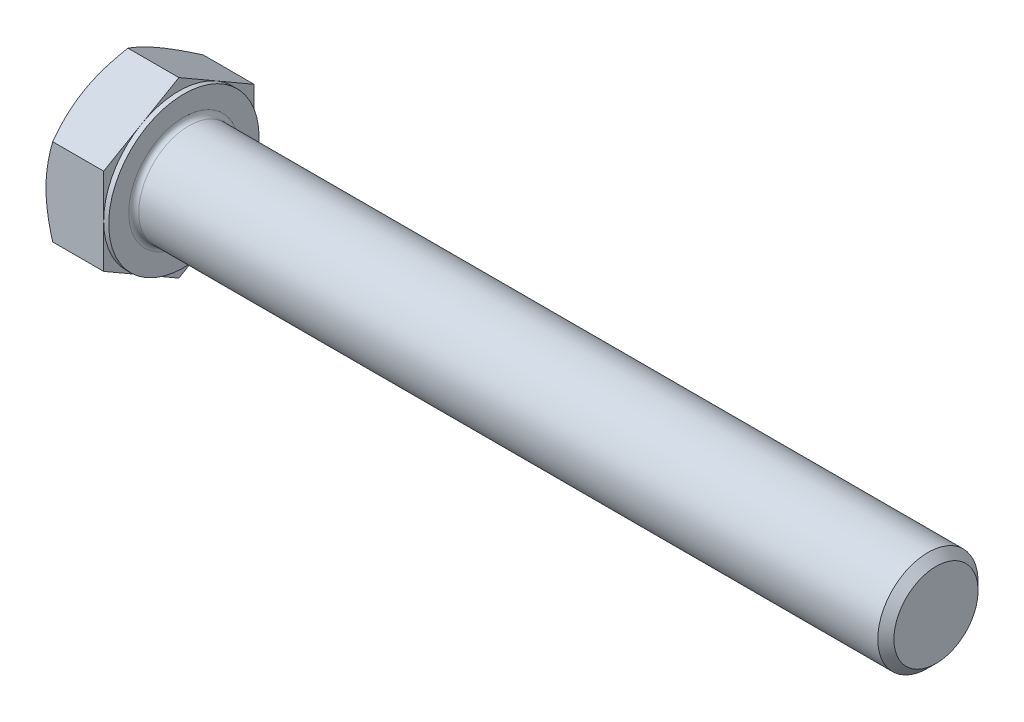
ISO-10303-21;
HEADER;
FILE_DESCRIPTION(('STEP AP214'),'2;1');
FILE_NAME('part.step','',(''),(''),'','','');
FILE_SCHEMA(('AUTOMOTIVE_DESIGN { 1 0 10303 214 1 1 1 1 }'));
ENDSEC;
DATA;
#1=APPLICATION_CONTEXT('core data for automotive mechanical design processes');
#2=APPLICATION_PROTOCOL_DEFINITION('international standard','automotive_design',2000,#1);
#3=PRODUCT_CONTEXT('',#1,'mechanical');
#4=PRODUCT('Part','Part','',(#3));
#5=PRODUCT_RELATED_PRODUCT_CATEGORY('part','',(#4));
#6=PRODUCT_DEFINITION_FORMATION('','',#4);
#7=PRODUCT_DEFINITION_CONTEXT('part definition',#1,'design');
#8=PRODUCT_DEFINITION('design','',#6,#7);
#9=PRODUCT_DEFINITION_SHAPE('','',#8);
#10=(LENGTH_UNIT() NAMED_UNIT(*) SI_UNIT(.MILLI.,.METRE.));
#11=(NAMED_UNIT(*) PLANE_ANGLE_UNIT() SI_UNIT($,.RADIAN.));
#12=(NAMED_UNIT(*) SI_UNIT($,.STERADIAN.) SOLID_ANGLE_UNIT());
#13=UNCERTAINTY_MEASURE_WITH_UNIT(LENGTH_MEASURE(1.E-05),#10,'distance_accuracy_value','');
#14=(GEOMETRIC_REPRESENTATION_CONTEXT(3) GLOBAL_UNCERTAINTY_ASSIGNED_CONTEXT((#13)) GLOBAL_UNIT_ASSIGNED_CONTEXT((#10,
#11,#12)) REPRESENTATION_CONTEXT('',''));
#15=CARTESIAN_POINT('',(0.,0.,0.));
#16=DIRECTION('',(0.,0.,1.));
#17=DIRECTION('',(1.,0.,0.));
#18=AXIS2_PLACEMENT_3D('',#15,#16,#17);
#19=CARTESIAN_POINT('',(7.5,10.3923048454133,0.));
#20=DIRECTION('',(1.,0.,0.));
#21=DIRECTION('',(0.,0.,-1.));
#22=AXIS2_PLACEMENT_3D('',#19,#20,#21);
#23=PLANE('',#22);
#24=CARTESIAN_POINT('',(7.5,0.,0.));
#25=DIRECTION('',(1.,0.,0.));
#26=DIRECTION('',(0.,0.,-1.));
#27=AXIS2_PLACEMENT_3D('',#24,#25,#26);
#28=CIRCLE('',#27,6.6);
#29=CARTESIAN_POINT('',(7.5,0.,-6.6));
#30=VERTEX_POINT('',#29);
#31=EDGE_CURVE('E41',#30,#30,#28,.F.);
#32=ORIENTED_EDGE('',*,*,#31,.T.);
#33=EDGE_LOOP('',(#32));
#34=FACE_BOUND('',#33,.T.);
#35=CARTESIAN_POINT('',(7.5,0.,0.));
#36=DIRECTION('',(1.,0.,0.));
#37=DIRECTION('',(0.,0.,-1.));
#38=AXIS2_PLACEMENT_3D('',#35,#36,#37);
#39=CIRCLE('',#38,9.);
#40=CARTESIAN_POINT('',(7.5,0.,-9.));
#41=VERTEX_POINT('',#40);
#42=EDGE_CURVE('E292',#41,#41,#39,.T.);
#43=ORIENTED_EDGE('',*,*,#42,.T.);
#44=EDGE_LOOP('',(#43));
#45=FACE_BOUND('',#44,.T.);
#46=ADVANCED_FACE('F33',(#34,#45),#23,.T.);
#47=CARTESIAN_POINT('',(0.,0.,0.));
#48=DIRECTION('',(-1.,0.,0.));
#49=DIRECTION('',(0.,0.,1.));
#50=AXIS2_PLACEMENT_3D('',#47,#48,#49);
#51=CYLINDRICAL_SURFACE('',#50,6.);
#52=CARTESIAN_POINT('',(8.1,0.,0.));
#53=DIRECTION('',(1.,0.,0.));
#54=DIRECTION('',(0.,0.,-1.));
#55=AXIS2_PLACEMENT_3D('',#52,#53,#54);
#56=CIRCLE('',#55,6.);
#57=CARTESIAN_POINT('',(8.1,0.,-6.));
#58=VERTEX_POINT('',#57);
#59=EDGE_CURVE('E11',#58,#58,#56,.T.);
#60=ORIENTED_EDGE('',*,*,#59,.T.);
#61=EDGE_LOOP('',(#60));
#62=FACE_BOUND('',#61,.T.);
#63=CARTESIAN_POINT('',(96.536,0.,0.));
#64=DIRECTION('',(-1.,0.,0.));
#65=DIRECTION('',(0.,0.,1.));
#66=AXIS2_PLACEMENT_3D('',#63,#64,#65);
#67=CIRCLE('',#66,6.);
#68=CARTESIAN_POINT('',(96.536,0.,6.));
#69=VERTEX_POINT('',#68);
#70=EDGE_CURVE('E271',#69,#69,#67,.T.);
#71=ORIENTED_EDGE('',*,*,#70,.T.);
#72=EDGE_LOOP('',(#71));
#73=FACE_BOUND('',#72,.T.);
#74=ADVANCED_FACE('F245',(#62,#73),#51,.T.);
#75=CARTESIAN_POINT('',(97.5,0.,0.));
#76=DIRECTION('',(-1.,0.,0.));
#77=DIRECTION('',(0.,0.,1.));
#78=AXIS2_PLACEMENT_3D('',#75,#76,#77);
#79=CONICAL_SURFACE('',#78,5.036,0.785398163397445);
#80=ORIENTED_EDGE('',*,*,#70,.F.);
#81=EDGE_LOOP('',(#80));
#82=FACE_BOUND('',#81,.T.);
#83=CARTESIAN_POINT('',(97.5,0.,0.));
#84=DIRECTION('',(-1.,0.,0.));
#85=DIRECTION('',(0.,0.,1.));
#86=AXIS2_PLACEMENT_3D('',#83,#84,#85);
#87=CIRCLE('',#86,5.036);
#88=CARTESIAN_POINT('',(97.5,0.,5.036));
#89=VERTEX_POINT('',#88);
#90=EDGE_CURVE('E269',#89,#89,#87,.T.);
#91=ORIENTED_EDGE('',*,*,#90,.T.);
#92=EDGE_LOOP('',(#91));
#93=FACE_BOUND('',#92,.T.);
#94=ADVANCED_FACE('F250',(#82,#93),#79,.T.);
#95=CARTESIAN_POINT('',(97.5,0.,0.));
#96=DIRECTION('',(-1.,0.,0.));
#97=DIRECTION('',(0.,0.,1.));
#98=AXIS2_PLACEMENT_3D('',#95,#96,#97);
#99=PLANE('',#98);
#100=ORIENTED_EDGE('',*,*,#90,.F.);
#101=EDGE_LOOP('',(#100));
#102=FACE_BOUND('',#101,.T.);
#103=ADVANCED_FACE('F257',(#102),#99,.F.);
#104=CARTESIAN_POINT('',(6.9,9.,0.));
#105=DIRECTION('',(1.,0.,0.));
#106=DIRECTION('',(0.,0.,-1.));
#107=AXIS2_PLACEMENT_3D('',#104,#105,#106);
#108=PLANE('',#107);
#109=DIRECTION('',(0.,0.500000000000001,0.866025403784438));
#110=VECTOR('',#109,1.);
#111=CARTESIAN_POINT('',(6.9,5.19615242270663,-9.));
#112=LINE('',#111,#110);
#113=CARTESIAN_POINT('',(6.9,5.19615242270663,-9.));
#114=VERTEX_POINT('',#113);
#115=CARTESIAN_POINT('',(6.9,7.79422863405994,-4.50000000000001));
#116=VERTEX_POINT('',#115);
#117=EDGE_CURVE('E165',#114,#116,#112,.T.);
#118=ORIENTED_EDGE('',*,*,#117,.T.);
#119=CARTESIAN_POINT('',(6.9,0.,0.));
#120=DIRECTION('',(-1.,0.,0.));
#121=DIRECTION('',(0.,0.,1.));
#122=AXIS2_PLACEMENT_3D('',#119,#120,#121);
#123=CIRCLE('',#122,9.);
#124=CARTESIAN_POINT('',(6.9,0.,-9.));
#125=VERTEX_POINT('',#124);
#126=EDGE_CURVE('E48',#116,#125,#123,.T.);
#127=ORIENTED_EDGE('',*,*,#126,.T.);
#128=DIRECTION('',(0.,1.,0.));
#129=VECTOR('',#128,1.);
#130=CARTESIAN_POINT('',(6.9,5.19615242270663,-9.));
#131=LINE('',#130,#129);
#132=EDGE_CURVE('E295',#125,#114,#131,.T.);
#133=ORIENTED_EDGE('',*,*,#132,.T.);
#134=EDGE_LOOP('',(#118,#127,#133));
#135=FACE_BOUND('',#134,.T.);
#136=ADVANCED_FACE('F260',(#135),#108,.T.);
#137=CARTESIAN_POINT('',(6.9,10.3923048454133,0.));
#138=VERTEX_POINT('',#137);
#139=EDGE_CURVE('E163',#116,#138,#112,.T.);
#140=ORIENTED_EDGE('',*,*,#139,.T.);
#141=DIRECTION('',(0.,-0.500000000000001,0.866025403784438));
#142=VECTOR('',#141,1.);
#143=CARTESIAN_POINT('',(6.9,10.3923048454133,0.));
#144=LINE('',#143,#142);
#145=CARTESIAN_POINT('',(6.9,7.79422863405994,4.50000000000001));
#146=VERTEX_POINT('',#145);
#147=EDGE_CURVE('E162',#138,#146,#144,.T.);
#148=ORIENTED_EDGE('',*,*,#147,.T.);
#149=EDGE_CURVE('E151',#146,#116,#123,.T.);
#150=ORIENTED_EDGE('',*,*,#149,.T.);
#151=EDGE_LOOP('',(#140,#148,#150));
#152=FACE_BOUND('',#151,.T.);
#153=ADVANCED_FACE('F265',(#152),#108,.T.);
#154=CARTESIAN_POINT('',(6.9,5.19615242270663,9.));
#155=VERTEX_POINT('',#154);
#156=EDGE_CURVE('E130',#146,#155,#144,.T.);
#157=ORIENTED_EDGE('',*,*,#156,.T.);
#158=DIRECTION('',(0.,-1.,0.));
#159=VECTOR('',#158,1.);
#160=CARTESIAN_POINT('',(6.9,5.19615242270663,9.));
#161=LINE('',#160,#159);
#162=CARTESIAN_POINT('',(6.9,0.,9.));
#163=VERTEX_POINT('',#162);
#164=EDGE_CURVE('E124',#155,#163,#161,.T.);
#165=ORIENTED_EDGE('',*,*,#164,.T.);
#166=EDGE_CURVE('E128',#163,#146,#123,.T.);
#167=ORIENTED_EDGE('',*,*,#166,.T.);
#168=EDGE_LOOP('',(#157,#165,#167));
#169=FACE_BOUND('',#168,.T.);
#170=ADVANCED_FACE('F126',(#169),#108,.T.);
#171=CARTESIAN_POINT('',(6.9,-5.1961524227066,9.));
#172=VERTEX_POINT('',#171);
#173=EDGE_CURVE('E134',#163,#172,#161,.T.);
#174=ORIENTED_EDGE('',*,*,#173,.T.);
#175=DIRECTION('',(0.,-0.500000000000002,-0.866025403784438));
#176=VECTOR('',#175,1.);
#177=CARTESIAN_POINT('',(6.9,-10.3923048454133,0.));
#178=LINE('',#177,#176);
#179=CARTESIAN_POINT('',(6.9,-7.79422863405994,4.50000000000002));
#180=VERTEX_POINT('',#179);
#181=EDGE_CURVE('E141',#172,#180,#178,.T.);
#182=ORIENTED_EDGE('',*,*,#181,.T.);
#183=EDGE_CURVE('E138',#180,#163,#123,.T.);
#184=ORIENTED_EDGE('',*,*,#183,.T.);
#185=EDGE_LOOP('',(#174,#182,#184));
#186=FACE_BOUND('',#185,.T.);
#187=ADVANCED_FACE('F139',(#186),#108,.T.);
#188=CARTESIAN_POINT('',(6.9,-10.3923048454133,0.));
#189=VERTEX_POINT('',#188);
#190=EDGE_CURVE('E157',#180,#189,#178,.T.);
#191=ORIENTED_EDGE('',*,*,#190,.T.);
#192=DIRECTION('',(0.,0.499999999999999,-0.866025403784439));
#193=VECTOR('',#192,1.);
#194=CARTESIAN_POINT('',(6.9,-5.19615242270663,-9.));
#195=LINE('',#194,#193);
#196=CARTESIAN_POINT('',(6.9,-7.79422863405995,-4.49999999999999));
#197=VERTEX_POINT('',#196);
#198=EDGE_CURVE('E333',#189,#197,#195,.T.);
#199=ORIENTED_EDGE('',*,*,#198,.T.);
#200=EDGE_CURVE('E145',#197,#180,#123,.T.);
#201=ORIENTED_EDGE('',*,*,#200,.T.);
#202=EDGE_LOOP('',(#191,#199,#201));
#203=FACE_BOUND('',#202,.T.);
#204=ADVANCED_FACE('F334',(#203),#108,.T.);
#205=CARTESIAN_POINT('',(6.9,-5.19615242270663,-9.));
#206=VERTEX_POINT('',#205);
#207=EDGE_CURVE('E152',#197,#206,#195,.T.);
#208=ORIENTED_EDGE('',*,*,#207,.T.);
#209=EDGE_CURVE('E296',#206,#125,#131,.T.);
#210=ORIENTED_EDGE('',*,*,#209,.T.);
#211=EDGE_CURVE('E303',#125,#197,#123,.T.);
#212=ORIENTED_EDGE('',*,*,#211,.T.);
#213=EDGE_LOOP('',(#208,#210,#212));
#214=FACE_BOUND('',#213,.T.);
#215=ADVANCED_FACE('F266',(#214),#108,.T.);
#216=CARTESIAN_POINT('',(0.,0.,0.));
#217=DIRECTION('',(-1.,0.,0.));
#218=DIRECTION('',(0.,0.,1.));
#219=AXIS2_PLACEMENT_3D('',#216,#217,#218);
#220=CYLINDRICAL_SURFACE('',#219,9.);
#221=ORIENTED_EDGE('',*,*,#126,.F.);
#222=ORIENTED_EDGE('',*,*,#149,.F.);
#223=ORIENTED_EDGE('',*,*,#166,.F.);
#224=ORIENTED_EDGE('',*,*,#183,.F.);
#225=ORIENTED_EDGE('',*,*,#200,.F.);
#226=ORIENTED_EDGE('',*,*,#211,.F.);
#227=EDGE_LOOP('',(#221,#222,#223,#224,#225,#226));
#228=FACE_BOUND('',#227,.T.);
#229=ORIENTED_EDGE('',*,*,#42,.F.);
#230=EDGE_LOOP('',(#229));
#231=FACE_BOUND('',#230,.T.);
#232=ADVANCED_FACE('F148',(#228,#231),#220,.T.);
#233=CARTESIAN_POINT('',(0.,10.3923048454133,0.));
#234=DIRECTION('',(1.,0.,0.));
#235=DIRECTION('',(0.,0.,-1.));
#236=AXIS2_PLACEMENT_3D('',#233,#234,#235);
#237=PLANE('',#236);
#238=CARTESIAN_POINT('',(0.,0.,0.));
#239=DIRECTION('',(1.,0.,0.));
#240=DIRECTION('',(0.,0.,-1.));
#241=AXIS2_PLACEMENT_3D('',#238,#239,#240);
#242=CIRCLE('',#241,9.);
#243=CARTESIAN_POINT('',(0.,0.,-9.));
#244=VERTEX_POINT('',#243);
#245=CARTESIAN_POINT('',(0.,7.79422863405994,-4.50000000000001));
#246=VERTEX_POINT('',#245);
#247=EDGE_CURVE('E291',#244,#246,#242,.T.);
#248=ORIENTED_EDGE('',*,*,#247,.F.);
#249=CARTESIAN_POINT('',(0.,-7.79422863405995,-4.49999999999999));
#250=VERTEX_POINT('',#249);
#251=EDGE_CURVE('E287',#250,#244,#242,.T.);
#252=ORIENTED_EDGE('',*,*,#251,.F.);
#253=CARTESIAN_POINT('',(0.,-7.79422863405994,4.50000000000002));
#254=VERTEX_POINT('',#253);
#255=EDGE_CURVE('E290',#254,#250,#242,.T.);
#256=ORIENTED_EDGE('',*,*,#255,.F.);
#257=CARTESIAN_POINT('',(0.,0.,9.));
#258=VERTEX_POINT('',#257);
#259=EDGE_CURVE('E326',#258,#254,#242,.T.);
#260=ORIENTED_EDGE('',*,*,#259,.F.);
#261=CARTESIAN_POINT('',(0.,0.,0.));
#262=DIRECTION('',(-1.,0.,0.));
#263=DIRECTION('',(0.,0.,1.));
#264=AXIS2_PLACEMENT_3D('',#261,#262,#263);
#265=CIRCLE('',#264,9.);
#266=CARTESIAN_POINT('',(0.,7.79422863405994,4.50000000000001));
#267=VERTEX_POINT('',#266);
#268=EDGE_CURVE('E166',#258,#267,#265,.T.);
#269=ORIENTED_EDGE('',*,*,#268,.T.);
#270=EDGE_CURVE('E349',#246,#267,#242,.T.);
#271=ORIENTED_EDGE('',*,*,#270,.F.);
#272=EDGE_LOOP('',(#248,#252,#256,#260,#269,#271));
#273=FACE_BOUND('',#272,.T.);
#274=ADVANCED_FACE('F195',(#273),#237,.F.);
#275=CARTESIAN_POINT('',(0.,0.,0.));
#276=DIRECTION('',(1.,0.,0.));
#277=DIRECTION('',(0.,0.,-1.));
#278=AXIS2_PLACEMENT_3D('',#275,#276,#277);
#279=CONICAL_SURFACE('',#278,9.,1.0471975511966);
#280=CARTESIAN_POINT('',(0.803914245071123,5.19603695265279,9.0002));
#281=CARTESIAN_POINT('',(0.737982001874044,5.31024090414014,8.80239295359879));
#282=CARTESIAN_POINT('',(0.675041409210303,5.42489028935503,8.60381439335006));
#283=CARTESIAN_POINT('',(0.555968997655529,5.65512011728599,8.20504463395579));
#284=CARTESIAN_POINT('',(0.499840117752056,5.77070093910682,8.00485277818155));
#285=CARTESIAN_POINT('',(0.395151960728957,6.00300811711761,7.60248494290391));
#286=CARTESIAN_POINT('',(0.346610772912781,6.11973652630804,7.40030540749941));
#287=CARTESIAN_POINT('',(0.258148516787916,6.35398725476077,6.99457124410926));
#288=CARTESIAN_POINT('',(0.218225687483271,6.47150940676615,6.7910169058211));
#289=CARTESIAN_POINT('',(0.148684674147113,6.70436794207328,6.38769409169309));
#290=CARTESIAN_POINT('',(0.118837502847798,6.81968712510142,6.187955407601));
#291=CARTESIAN_POINT('',(0.0687933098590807,7.05084147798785,5.78758432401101));
#292=CARTESIAN_POINT('',(0.04859543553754,7.16667660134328,5.5869520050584));
#293=CARTESIAN_POINT('',(0.0183543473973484,7.39854776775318,5.18533936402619));
#294=CARTESIAN_POINT('',(0.00829960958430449,7.51458343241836,4.98435969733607));
#295=CARTESIAN_POINT('',(-0.00143766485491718,7.74676155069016,4.58221540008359));
#296=CARTESIAN_POINT('',(-0.00112052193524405,7.86290400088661,4.38105077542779));
#297=CARTESIAN_POINT('',(0.00916395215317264,8.08003584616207,4.00496738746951));
#298=CARTESIAN_POINT('',(0.0178767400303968,8.18104055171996,3.83002210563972));
#299=CARTESIAN_POINT('',(0.0429773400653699,8.38281337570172,3.48054132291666));
#300=CARTESIAN_POINT('',(0.0593656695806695,8.4835814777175,3.30600585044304));
#301=CARTESIAN_POINT('',(0.11965655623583,8.7854956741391,2.7830751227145));
#302=CARTESIAN_POINT('',(0.174677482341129,8.98610736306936,2.43560548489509));
#303=CARTESIAN_POINT('',(0.312230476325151,9.38945876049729,1.73698037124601));
#304=CARTESIAN_POINT('',(0.395345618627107,9.59214699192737,1.38591405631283));
#305=CARTESIAN_POINT('',(0.583982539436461,9.99450087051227,0.689016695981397));
#306=CARTESIAN_POINT('',(0.689460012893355,10.1941716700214,0.343176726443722));
#307=CARTESIAN_POINT('',(0.803914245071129,10.3924203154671,-0.000200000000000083));
#308=B_SPLINE_CURVE_WITH_KNOTS('',3,(#280,#281,#282,#283,#284,#285,#286,#287,#288,#289,#290,
#291,#292,#293,#294,#295,#296,#297,#298,#299,#300,#301,#302,#303,#304,#305,#306,#307),
.UNSPECIFIED.,.F.,.F.,(4,2,2,2,2,2,2,2,2,2,2,2,2,4),(0.,0.713219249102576,1.42674513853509,
2.14194697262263,2.8570025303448,3.55449749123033,4.25193080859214,4.94857085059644,
5.64518936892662,6.25162976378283,6.8581110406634,8.07193747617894,9.31268391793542,
10.5509947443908),.UNSPECIFIED.);
#309=CARTESIAN_POINT('',(0.803847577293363,10.3923048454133,0.));
#310=VERTEX_POINT('',#309);
#311=EDGE_CURVE('E214',#267,#310,#308,.T.);
#312=ORIENTED_EDGE('',*,*,#311,.T.);
#313=CARTESIAN_POINT('',(0.803914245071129,10.3924203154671,0.000200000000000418));
#314=CARTESIAN_POINT('',(0.73798200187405,10.2782163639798,-0.197607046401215));
#315=CARTESIAN_POINT('',(0.675041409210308,10.1635669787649,-0.396185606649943));
#316=CARTESIAN_POINT('',(0.555968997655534,9.93333715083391,-0.794955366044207));
#317=CARTESIAN_POINT('',(0.499840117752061,9.81775632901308,-0.995147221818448));
#318=CARTESIAN_POINT('',(0.395151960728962,9.58544915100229,-1.39751505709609));
#319=CARTESIAN_POINT('',(0.346610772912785,9.46872074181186,-1.59969459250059));
#320=CARTESIAN_POINT('',(0.25814851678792,9.23447001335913,-2.00542875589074));
#321=CARTESIAN_POINT('',(0.218225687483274,9.11694786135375,-2.20898309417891));
#322=CARTESIAN_POINT('',(0.148684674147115,8.88408932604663,-2.61230590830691));
#323=CARTESIAN_POINT('',(0.1188375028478,8.76877014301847,-2.812044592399));
#324=CARTESIAN_POINT('',(0.0687933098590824,8.53761579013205,-3.21241567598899));
#325=CARTESIAN_POINT('',(0.048595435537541,8.42178066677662,-3.4130479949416));
#326=CARTESIAN_POINT('',(0.0183543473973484,8.18990950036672,-3.81466063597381));
#327=CARTESIAN_POINT('',(0.00829960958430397,8.07387383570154,-4.01564030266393));
#328=CARTESIAN_POINT('',(-0.00143766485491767,7.84169571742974,-4.41778459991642));
#329=CARTESIAN_POINT('',(-0.00112052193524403,7.72555326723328,-4.61894922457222));
#330=CARTESIAN_POINT('',(0.00916395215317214,7.50842142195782,-4.9950326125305));
#331=CARTESIAN_POINT('',(0.0178767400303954,7.40741671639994,-5.16997789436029));
#332=CARTESIAN_POINT('',(0.042977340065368,7.20564389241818,-5.51945867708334));
#333=CARTESIAN_POINT('',(0.0593656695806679,7.1048757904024,-5.69399414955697));
#334=CARTESIAN_POINT('',(0.119656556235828,6.8029615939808,-6.2169248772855));
#335=CARTESIAN_POINT('',(0.174677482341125,6.60234990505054,-6.56439451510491));
#336=CARTESIAN_POINT('',(0.312230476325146,6.1989985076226,-7.263019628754));
#337=CARTESIAN_POINT('',(0.395345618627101,5.99631027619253,-7.61408594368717));
#338=CARTESIAN_POINT('',(0.583982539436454,5.59395639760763,-8.3109833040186));
#339=CARTESIAN_POINT('',(0.689460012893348,5.39428559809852,-8.65682327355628));
#340=CARTESIAN_POINT('',(0.803914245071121,5.19603695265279,-9.0002));
#341=B_SPLINE_CURVE_WITH_KNOTS('',3,(#313,#314,#315,#316,#317,#318,#319,#320,#321,#322,#323,
#324,#325,#326,#327,#328,#329,#330,#331,#332,#333,#334,#335,#336,#337,#338,#339,#340),
.UNSPECIFIED.,.F.,.F.,(4,2,2,2,2,2,2,2,2,2,2,2,2,4),(0.,0.713219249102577,1.42674513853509,
2.14194697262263,2.8570025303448,3.55449749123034,4.25193080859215,4.94857085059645,
5.64518936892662,6.25162976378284,6.85811104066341,8.07193747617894,9.31268391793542,
10.5509947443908),.UNSPECIFIED.);
#342=EDGE_CURVE('E56',#310,#246,#341,.T.);
#343=ORIENTED_EDGE('',*,*,#342,.T.);
#344=ORIENTED_EDGE('',*,*,#270,.T.);
#345=EDGE_LOOP('',(#312,#343,#344));
#346=FACE_BOUND('',#345,.T.);
#347=ADVANCED_FACE('F350',(#346),#279,.T.);
#348=CARTESIAN_POINT('',(4.5030834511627,-14.1853984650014,8.99999999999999));
#349=CARTESIAN_POINT('',(4.31054430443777,-13.7903499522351,8.99999999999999));
#350=CARTESIAN_POINT('',(4.11978647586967,-13.3944187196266,8.99999999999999));
#351=CARTESIAN_POINT('',(3.74283090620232,-12.6003222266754,8.99999999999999));
#352=CARTESIAN_POINT('',(3.55663384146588,-12.2021566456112,9.));
#353=CARTESIAN_POINT('',(3.18890856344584,-11.4011783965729,9.));
#354=CARTESIAN_POINT('',(3.00740939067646,-10.9983523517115,9.));
#355=CARTESIAN_POINT('',(2.65153988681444,-10.1895752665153,9.));
#356=CARTESIAN_POINT('',(2.47716923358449,-9.7836243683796,9.));
#357=CARTESIAN_POINT('',(2.13161244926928,-8.95398189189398,9.));
#358=CARTESIAN_POINT('',(1.96074001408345,-8.53015895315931,9.));
#359=CARTESIAN_POINT('',(1.63138410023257,-7.67764040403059,9.));
#360=CARTESIAN_POINT('',(1.47290197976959,-7.24894426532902,9.));
#361=CARTESIAN_POINT('',(1.17232155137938,-6.38672363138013,9.));
#362=CARTESIAN_POINT('',(1.03019194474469,-5.95321016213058,9.));
#363=CARTESIAN_POINT('',(0.766724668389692,-5.07998336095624,9.));
#364=CARTESIAN_POINT('',(0.645380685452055,-4.64027195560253,9.));
#365=CARTESIAN_POINT('',(0.429822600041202,-3.75682505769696,9.));
#366=CARTESIAN_POINT('',(0.335452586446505,-3.31312863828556,9.));
#367=CARTESIAN_POINT('',(0.218090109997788,-2.64336713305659,9.));
#368=CARTESIAN_POINT('',(0.182999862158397,-2.41939560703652,9.));
#369=CARTESIAN_POINT('',(0.121565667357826,-1.97026354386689,9.));
#370=CARTESIAN_POINT('',(0.0952208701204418,-1.74510312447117,9.));
#371=CARTESIAN_POINT('',(0.0521451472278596,-1.2969348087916,9.));
#372=CARTESIAN_POINT('',(0.0352889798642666,-1.0739390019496,9.));
#373=CARTESIAN_POINT('',(0.0110310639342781,-0.627433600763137,9.));
#374=CARTESIAN_POINT('',(0.00362915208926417,-0.403924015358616,9.));
#375=CARTESIAN_POINT('',(-0.00154262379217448,0.0432079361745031,9.));
#376=CARTESIAN_POINT('',(0.000687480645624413,0.266830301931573,9.));
#377=CARTESIAN_POINT('',(0.0147226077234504,0.713776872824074,9.));
#378=CARTESIAN_POINT('',(0.0265280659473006,0.937101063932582,9.));
#379=CARTESIAN_POINT('',(0.0656502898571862,1.46707211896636,9.));
#380=CARTESIAN_POINT('',(0.0971347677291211,1.77341845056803,9.));
#381=CARTESIAN_POINT('',(0.176454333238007,2.38397028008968,9.));
#382=CARTESIAN_POINT('',(0.224291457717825,2.68817550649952,9.));
#383=CARTESIAN_POINT('',(0.38980640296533,3.59715813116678,9.));
#384=CARTESIAN_POINT('',(0.529461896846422,4.19799412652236,9.));
#385=CARTESIAN_POINT('',(0.77333187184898,5.09670706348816,9.));
#386=CARTESIAN_POINT('',(0.861532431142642,5.39919910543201,9.));
#387=CARTESIAN_POINT('',(1.04752099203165,6.00125026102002,9.));
#388=CARTESIAN_POINT('',(1.14530906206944,6.30080935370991,9.));
#389=CARTESIAN_POINT('',(1.34886866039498,6.89708058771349,9.));
#390=CARTESIAN_POINT('',(1.45463787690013,7.19379352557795,9.));
#391=CARTESIAN_POINT('',(1.67287301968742,7.78473287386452,9.));
#392=CARTESIAN_POINT('',(1.78533883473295,8.07895932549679,9.));
#393=CARTESIAN_POINT('',(2.07523735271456,8.81619444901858,9.));
#394=CARTESIAN_POINT('',(2.25629467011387,9.25777584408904,9.));
#395=CARTESIAN_POINT('',(2.62827522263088,10.1367776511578,9.));
#396=CARTESIAN_POINT('',(2.819199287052,10.5741977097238,9.));
#397=CARTESIAN_POINT('',(3.20877963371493,11.4457286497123,9.));
#398=CARTESIAN_POINT('',(3.40743823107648,11.8798384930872,9.));
#399=CARTESIAN_POINT('',(3.81079737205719,12.7452179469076,9.));
#400=CARTESIAN_POINT('',(4.01549773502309,13.176487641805,9.00000000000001));
#401=CARTESIAN_POINT('',(4.43000777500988,14.0372827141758,9.00000000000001));
#402=CARTESIAN_POINT('',(4.63982402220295,14.4668049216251,9.00000000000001));
#403=CARTESIAN_POINT('',(5.06336871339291,15.3239162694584,9.00000000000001));
#404=CARTESIAN_POINT('',(5.27709718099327,15.7515053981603,9.00000000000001));
#405=CARTESIAN_POINT('',(5.70771289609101,16.6049951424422,9.00000000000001));
#406=CARTESIAN_POINT('',(5.92459958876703,17.0308960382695,9.00000000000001));
#407=CARTESIAN_POINT('',(6.36101693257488,17.8813418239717,9.00000000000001));
#408=CARTESIAN_POINT('',(6.58054759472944,18.305886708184,9.00000000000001));
#409=CARTESIAN_POINT('',(7.20096689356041,19.4981240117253,9.00000000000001));
#410=CARTESIAN_POINT('',(7.60436223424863,20.2645118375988,9.00000000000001));
#411=CARTESIAN_POINT('',(8.41646747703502,21.7945065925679,9.00000000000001));
#412=CARTESIAN_POINT('',(8.82517763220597,22.558113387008,9.00000000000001));
#413=CARTESIAN_POINT('',(9.64538992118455,24.0808854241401,9.00000000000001));
#414=CARTESIAN_POINT('',(10.0568800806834,24.8400571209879,9.00000000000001));
#415=CARTESIAN_POINT('',(10.6764233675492,25.9775231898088,9.00000000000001));
#416=CARTESIAN_POINT('',(10.8833155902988,26.3564507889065,9.00000000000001));
#417=CARTESIAN_POINT('',(11.2977907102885,27.1139273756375,9.00000000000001));
#418=CARTESIAN_POINT('',(11.5053736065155,27.492476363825,9.00000000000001));
#419=CARTESIAN_POINT('',(11.7132605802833,27.8708583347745,9.00000000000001));
#420=B_SPLINE_CURVE_WITH_KNOTS('',3,(#348,#349,#350,#351,#352,#353,#354,#355,#356,#357,#358,
#359,#360,#361,#362,#363,#364,#365,#366,#367,#368,#369,#370,#371,#372,#373,#374,#375,#376,#377,
#378,#379,#380,#381,#382,#383,#384,#385,#386,#387,#388,#389,#390,#391,#392,#393,#394,#395,#396,
#397,#398,#399,#400,#401,#402,#403,#404,#405,#406,#407,#408,#409,#410,#411,#412,#413,#414,#415,
#416,#417,#418,#419),.UNSPECIFIED.,.F.,.F.,(4,2,2,2,2,2,2,2,2,2,2,2,2,2,2,2,2,2,2,2,2,2,2,2,2,2,
2,2,2,2,2,2,2,2,2,4),(0.,1.31842765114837,2.6370496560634,3.96247407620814,5.28783853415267,
6.65860358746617,8.029518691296,9.3977646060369,10.7655942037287,12.1253499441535,
12.8053173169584,13.4852185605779,14.1559216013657,14.8266130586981,15.4973023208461,
16.1680220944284,17.0913849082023,18.0148627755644,19.862742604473,20.8079230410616,
21.7531102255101,22.6980246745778,23.6429234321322,25.0745302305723,26.5062575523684,
27.9384167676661,29.3705332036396,30.8045973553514,32.2386701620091,33.6724940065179,
35.1063238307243,37.7045032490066,40.3028068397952,42.8933552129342,44.1885437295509,
45.4837303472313),.UNSPECIFIED.);
#421=CARTESIAN_POINT('',(0.803847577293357,5.19615242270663,9.));
#422=VERTEX_POINT('',#421);
#423=EDGE_CURVE('E226',#258,#422,#420,.T.);
#424=ORIENTED_EDGE('',*,*,#423,.T.);
#425=EDGE_CURVE('E225',#422,#267,#308,.T.);
#426=ORIENTED_EDGE('',*,*,#425,.T.);
#427=ORIENTED_EDGE('',*,*,#268,.F.);
#428=EDGE_LOOP('',(#424,#426,#427));
#429=FACE_BOUND('',#428,.T.);
#430=ADVANCED_FACE('F320',(#429),#279,.T.);
#431=CARTESIAN_POINT('',(0.803847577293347,-5.1961524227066,9.));
#432=VERTEX_POINT('',#431);
#433=EDGE_CURVE('E272',#432,#258,#420,.T.);
#434=ORIENTED_EDGE('',*,*,#433,.T.);
#435=ORIENTED_EDGE('',*,*,#259,.T.);
#436=CARTESIAN_POINT('',(0.803914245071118,-10.3924203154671,-0.000200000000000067));
#437=CARTESIAN_POINT('',(0.737982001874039,-10.2782163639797,0.197607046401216));
#438=CARTESIAN_POINT('',(0.675041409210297,-10.1635669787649,0.396185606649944));
#439=CARTESIAN_POINT('',(0.555968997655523,-9.93333715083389,0.794955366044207));
#440=CARTESIAN_POINT('',(0.499840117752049,-9.81775632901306,0.995147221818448));
#441=CARTESIAN_POINT('',(0.39515196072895,-9.58544915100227,1.39751505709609));
#442=CARTESIAN_POINT('',(0.346610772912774,-9.46872074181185,1.59969459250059));
#443=CARTESIAN_POINT('',(0.258148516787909,-9.23447001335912,2.00542875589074));
#444=CARTESIAN_POINT('',(0.218225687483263,-9.11694786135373,2.2089830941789));
#445=CARTESIAN_POINT('',(0.148684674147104,-8.88408932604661,2.6123059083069));
#446=CARTESIAN_POINT('',(0.118837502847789,-8.76877014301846,2.81204459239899));
#447=CARTESIAN_POINT('',(0.0687933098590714,-8.53761579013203,3.21241567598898));
#448=CARTESIAN_POINT('',(0.0485954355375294,-8.4217806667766,3.41304799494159));
#449=CARTESIAN_POINT('',(0.0183543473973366,-8.1899095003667,3.8146606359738));
#450=CARTESIAN_POINT('',(0.00829960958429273,-8.07387383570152,4.01564030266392));
#451=CARTESIAN_POINT('',(-0.00143766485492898,-7.84169571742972,4.41778459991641));
#452=CARTESIAN_POINT('',(-0.00112052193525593,-7.72555326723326,4.61894922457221));
#453=CARTESIAN_POINT('',(0.00916395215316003,-7.5084214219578,4.99503261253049));
#454=CARTESIAN_POINT('',(0.0178767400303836,-7.40741671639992,5.16997789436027));
#455=CARTESIAN_POINT('',(0.0429773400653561,-7.20564389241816,5.51945867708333));
#456=CARTESIAN_POINT('',(0.0593656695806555,-7.10487579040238,5.69399414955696));
#457=CARTESIAN_POINT('',(0.119656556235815,-6.80296159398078,6.21692487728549));
#458=CARTESIAN_POINT('',(0.174677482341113,-6.60234990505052,6.5643945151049));
#459=CARTESIAN_POINT('',(0.312230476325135,-6.19899850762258,7.26301962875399));
#460=CARTESIAN_POINT('',(0.39534561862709,-5.9963102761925,7.61408594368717));
#461=CARTESIAN_POINT('',(0.583982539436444,-5.5939563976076,8.3109833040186));
#462=CARTESIAN_POINT('',(0.689460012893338,-5.3942855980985,8.65682327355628));
#463=CARTESIAN_POINT('',(0.803914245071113,-5.19603695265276,9.0002));
#464=B_SPLINE_CURVE_WITH_KNOTS('',3,(#436,#437,#438,#439,#440,#441,#442,#443,#444,#445,#446,
#447,#448,#449,#450,#451,#452,#453,#454,#455,#456,#457,#458,#459,#460,#461,#462,#463),
.UNSPECIFIED.,.F.,.F.,(4,2,2,2,2,2,2,2,2,2,2,2,2,4),(0.,0.713219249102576,1.42674513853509,
2.14194697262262,2.8570025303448,3.55449749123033,4.25193080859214,4.94857085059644,
5.64518936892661,6.25162976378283,6.8581110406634,8.07193747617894,9.31268391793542,
10.5509947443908),.UNSPECIFIED.);
#465=EDGE_CURVE('E216',#254,#432,#464,.T.);
#466=ORIENTED_EDGE('',*,*,#465,.T.);
#467=EDGE_LOOP('',(#434,#435,#466));
#468=FACE_BOUND('',#467,.T.);
#469=ADVANCED_FACE('F184',(#468),#279,.T.);
#470=CARTESIAN_POINT('',(0.803847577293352,-10.3923048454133,0.));
#471=VERTEX_POINT('',#470);
#472=EDGE_CURVE('E209',#471,#254,#464,.T.);
#473=ORIENTED_EDGE('',*,*,#472,.T.);
#474=ORIENTED_EDGE('',*,*,#255,.T.);
#475=CARTESIAN_POINT('',(0.803914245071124,-5.1960369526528,-9.0002));
#476=CARTESIAN_POINT('',(0.737982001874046,-5.31024090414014,-8.80239295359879));
#477=CARTESIAN_POINT('',(0.675041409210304,-5.42489028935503,-8.60381439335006));
#478=CARTESIAN_POINT('',(0.555968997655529,-5.65512011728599,-8.20504463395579));
#479=CARTESIAN_POINT('',(0.499840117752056,-5.77070093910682,-8.00485277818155));
#480=CARTESIAN_POINT('',(0.395151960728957,-6.00300811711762,-7.60248494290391));
#481=CARTESIAN_POINT('',(0.346610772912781,-6.11973652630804,-7.40030540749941));
#482=CARTESIAN_POINT('',(0.258148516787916,-6.35398725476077,-6.99457124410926));
#483=CARTESIAN_POINT('',(0.21822568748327,-6.47150940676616,-6.79101690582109));
#484=CARTESIAN_POINT('',(0.148684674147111,-6.70436794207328,-6.38769409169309));
#485=CARTESIAN_POINT('',(0.118837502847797,-6.81968712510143,-6.187955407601));
#486=CARTESIAN_POINT('',(0.0687933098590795,-7.05084147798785,-5.78758432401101));
#487=CARTESIAN_POINT('',(0.0485954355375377,-7.16667660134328,-5.5869520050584));
#488=CARTESIAN_POINT('',(0.018354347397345,-7.39854776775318,-5.18533936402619));
#489=CARTESIAN_POINT('',(0.00829960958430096,-7.51458343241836,-4.98435969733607));
#490=CARTESIAN_POINT('',(-0.00143766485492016,-7.74676155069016,-4.58221540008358));
#491=CARTESIAN_POINT('',(-0.00112052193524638,-7.86290400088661,-4.38105077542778));
#492=CARTESIAN_POINT('',(0.00916395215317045,-8.08003584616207,-4.0049673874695));
#493=CARTESIAN_POINT('',(0.0178767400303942,-8.18104055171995,-3.83002210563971));
#494=CARTESIAN_POINT('',(0.0429773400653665,-8.38281337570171,-3.48054132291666));
#495=CARTESIAN_POINT('',(0.0593656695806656,-8.4835814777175,-3.30600585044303));
#496=CARTESIAN_POINT('',(0.119656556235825,-8.78549567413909,-2.7830751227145));
#497=CARTESIAN_POINT('',(0.174677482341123,-8.98610736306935,-2.43560548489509));
#498=CARTESIAN_POINT('',(0.312230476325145,-9.38945876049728,-1.736980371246));
#499=CARTESIAN_POINT('',(0.3953456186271,-9.59214699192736,-1.38591405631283));
#500=CARTESIAN_POINT('',(0.583982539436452,-9.99450087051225,-0.689016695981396));
#501=CARTESIAN_POINT('',(0.689460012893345,-10.1941716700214,-0.343176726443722));
#502=CARTESIAN_POINT('',(0.803914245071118,-10.3924203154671,0.000200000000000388));
#503=B_SPLINE_CURVE_WITH_KNOTS('',3,(#475,#476,#477,#478,#479,#480,#481,#482,#483,#484,#485,
#486,#487,#488,#489,#490,#491,#492,#493,#494,#495,#496,#497,#498,#499,#500,#501,#502),
.UNSPECIFIED.,.F.,.F.,(4,2,2,2,2,2,2,2,2,2,2,2,2,4),(0.,0.713219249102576,1.42674513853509,
2.14194697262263,2.8570025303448,3.55449749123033,4.25193080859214,4.94857085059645,
5.64518936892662,6.25162976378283,6.8581110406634,8.07193747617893,9.31268391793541,
10.5509947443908),.UNSPECIFIED.);
#504=EDGE_CURVE('E215',#250,#471,#503,.T.);
#505=ORIENTED_EDGE('',*,*,#504,.T.);
#506=EDGE_LOOP('',(#473,#474,#505));
#507=FACE_BOUND('',#506,.T.);
#508=ADVANCED_FACE('F348',(#507),#279,.T.);
#509=CARTESIAN_POINT('',(0.803847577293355,5.19615242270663,-9.));
#510=VERTEX_POINT('',#509);
#511=EDGE_CURVE('E217',#246,#510,#341,.T.);
#512=ORIENTED_EDGE('',*,*,#511,.T.);
#513=CARTESIAN_POINT('',(4.50308345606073,-14.1853984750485,-9.));
#514=CARTESIAN_POINT('',(4.31054430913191,-13.7903499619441,-9.));
#515=CARTESIAN_POINT('',(4.11978648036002,-13.3944187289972,-9.));
#516=CARTESIAN_POINT('',(3.74283091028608,-12.6003222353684,-9.));
#517=CARTESIAN_POINT('',(3.55663384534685,-12.2021566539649,-9.));
#518=CARTESIAN_POINT('',(3.1889085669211,-11.4011784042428,-9.));
#519=CARTESIAN_POINT('',(3.00740939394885,-10.998352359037,-9.));
#520=CARTESIAN_POINT('',(2.65153988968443,-10.1895752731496,-9.));
#521=CARTESIAN_POINT('',(2.47716923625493,-9.78362437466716,-9.));
#522=CARTESIAN_POINT('',(2.13161245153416,-8.95398189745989,-9.));
#523=CARTESIAN_POINT('',(1.96074001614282,-8.53015895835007,-9.));
#524=CARTESIAN_POINT('',(1.63138410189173,-7.67764040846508,-9.));
#525=CARTESIAN_POINT('',(1.47290198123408,-7.24894426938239,-9.));
#526=CARTESIAN_POINT('',(1.17232155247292,-6.38672363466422,-9.));
#527=CARTESIAN_POINT('',(1.0301919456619,-5.95321016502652,-9.));
#528=CARTESIAN_POINT('',(0.766724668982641,-5.07998336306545,-9.));
#529=CARTESIAN_POINT('',(0.645380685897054,-4.64027195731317,-9.));
#530=CARTESIAN_POINT('',(0.429822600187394,-3.75682505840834,-9.));
#531=CARTESIAN_POINT('',(0.335452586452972,-3.31312863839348,-9.));
#532=CARTESIAN_POINT('',(0.218090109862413,-2.64336713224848,-9.));
#533=CARTESIAN_POINT('',(0.182999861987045,-2.41939560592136,-9.));
#534=CARTESIAN_POINT('',(0.12156566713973,-1.97026354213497,-9.));
#535=CARTESIAN_POINT('',(0.0952208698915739,-1.74510312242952,-9.));
#536=CARTESIAN_POINT('',(0.052145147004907,-1.29693480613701,-9.));
#537=CARTESIAN_POINT('',(0.0352889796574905,-1.07393899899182,-9.));
#538=CARTESIAN_POINT('',(0.0110310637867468,-0.627433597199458,-9.));
#539=CARTESIAN_POINT('',(0.00362915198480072,-0.403924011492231,-9.));
#540=CARTESIAN_POINT('',(-0.00154262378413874,0.0432079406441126,-9.));
#541=CARTESIAN_POINT('',(0.000687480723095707,0.266830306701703,-9.));
#542=CARTESIAN_POINT('',(0.0147226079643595,0.713776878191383,-9.));
#543=CARTESIAN_POINT('',(0.0265280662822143,0.93710106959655,-9.));
#544=CARTESIAN_POINT('',(0.0656502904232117,1.46707212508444,-9.));
#545=CARTESIAN_POINT('',(0.0971347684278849,1.77341845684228,-9.));
#546=CARTESIAN_POINT('',(0.176454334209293,2.3839702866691,-9.));
#547=CARTESIAN_POINT('',(0.224291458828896,2.68817551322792,-9.));
#548=CARTESIAN_POINT('',(0.389806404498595,3.59715813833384,-9.));
#549=CARTESIAN_POINT('',(0.529461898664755,4.19799413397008,-9.));
#550=CARTESIAN_POINT('',(0.773331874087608,5.09670707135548,-9.));
#551=CARTESIAN_POINT('',(0.861532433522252,5.39919911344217,-9.));
#552=CARTESIAN_POINT('',(1.04752099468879,6.00125026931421,-9.));
#553=CARTESIAN_POINT('',(1.14530906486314,6.30080936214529,-9.));
#554=CARTESIAN_POINT('',(1.34886866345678,6.89708059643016,-9.));
#555=CARTESIAN_POINT('',(1.45463788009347,7.19379353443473,-9.));
#556=CARTESIAN_POINT('',(1.67287302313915,7.78473288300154,-9.));
#557=CARTESIAN_POINT('',(1.78533883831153,8.07895933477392,-9.));
#558=CARTESIAN_POINT('',(2.07523735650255,8.81619445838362,-9.));
#559=CARTESIAN_POINT('',(2.25629467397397,9.25777585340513,-9.));
#560=CARTESIAN_POINT('',(2.62827522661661,10.136777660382,-9.));
#561=CARTESIAN_POINT('',(2.81919929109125,10.5741977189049,-9.));
#562=CARTESIAN_POINT('',(3.20877963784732,11.445728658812,-9.));
#563=CARTESIAN_POINT('',(3.40743823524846,11.8798385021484,-9.));
#564=CARTESIAN_POINT('',(3.81079737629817,12.745217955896,-9.));
#565=CARTESIAN_POINT('',(4.01549773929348,13.176487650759,-9.));
#566=CARTESIAN_POINT('',(4.43000777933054,14.0372827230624,-9.));
#567=CARTESIAN_POINT('',(4.63982402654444,14.4668049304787,-9.));
#568=CARTESIAN_POINT('',(5.06336871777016,15.3239162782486,-9.));
#569=CARTESIAN_POINT('',(5.27709718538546,15.7515054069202,-9.));
#570=CARTESIAN_POINT('',(5.70771290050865,16.6049951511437,-9.));
#571=CARTESIAN_POINT('',(5.9245995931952,17.0308960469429,-9.));
#572=CARTESIAN_POINT('',(6.36101693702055,17.8813418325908,-9.));
#573=CARTESIAN_POINT('',(6.58054759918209,18.3058867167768,-9.));
#574=CARTESIAN_POINT('',(7.20096689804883,19.4981240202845,-9.));
#575=CARTESIAN_POINT('',(7.60436223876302,20.2645118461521,-9.));
#576=CARTESIAN_POINT('',(8.41646748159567,21.794506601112,-9.));
#577=CARTESIAN_POINT('',(8.82517763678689,22.558113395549,-9.));
#578=CARTESIAN_POINT('',(9.64538992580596,24.0808854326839,-9.));
#579=CARTESIAN_POINT('',(10.0568800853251,24.8400571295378,-9.));
#580=CARTESIAN_POINT('',(10.6764233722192,25.977523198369,-9.));
#581=CARTESIAN_POINT('',(10.883315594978,26.3564507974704,-9.));
#582=CARTESIAN_POINT('',(11.2977907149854,27.113927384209,-9.));
#583=CARTESIAN_POINT('',(11.505373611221,27.4924763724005,-9.));
#584=CARTESIAN_POINT('',(11.713260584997,27.8708583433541,-9.));
#585=B_SPLINE_CURVE_WITH_KNOTS('',3,(#513,#514,#515,#516,#517,#518,#519,#520,#521,#522,#523,
#524,#525,#526,#527,#528,#529,#530,#531,#532,#533,#534,#535,#536,#537,#538,#539,#540,#541,#542,
#543,#544,#545,#546,#547,#548,#549,#550,#551,#552,#553,#554,#555,#556,#557,#558,#559,#560,#561,
#562,#563,#564,#565,#566,#567,#568,#569,#570,#571,#572,#573,#574,#575,#576,#577,#578,#579,#580,
#581,#582,#583,#584),.UNSPECIFIED.,.F.,.F.,(4,2,2,2,2,2,2,2,2,2,2,2,2,2,2,2,2,2,2,2,2,2,2,2,2,2,
2,2,2,2,2,2,2,2,2,4),(0.,1.3184276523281,2.63704965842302,3.96247407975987,5.28783853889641,
6.65860359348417,8.02951869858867,9.39776461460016,10.7655942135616,12.1253499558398,
12.8053173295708,13.4852185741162,14.1559216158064,14.8266130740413,15.497302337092,
16.1680221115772,17.0913849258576,18.0148627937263,19.8627426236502,20.8079230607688,
21.7531102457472,22.6980246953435,23.6429234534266,25.0745302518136,26.506257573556,
27.9384167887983,29.3705332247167,30.804597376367,32.2386701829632,33.6724940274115,
35.1063238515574,37.7045032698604,40.3028068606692,42.8933552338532,44.1885437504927,
45.4837303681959),.UNSPECIFIED.);
#586=EDGE_CURVE('E177',#510,#244,#585,.F.);
#587=ORIENTED_EDGE('',*,*,#586,.T.);
#588=ORIENTED_EDGE('',*,*,#247,.T.);
#589=EDGE_LOOP('',(#512,#587,#588));
#590=FACE_BOUND('',#589,.T.);
#591=ADVANCED_FACE('F345',(#590),#279,.T.);
#592=CARTESIAN_POINT('',(0.803847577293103,-5.19615242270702,-9.));
#593=VERTEX_POINT('',#592);
#594=EDGE_CURVE('E178',#593,#250,#503,.T.);
#595=ORIENTED_EDGE('',*,*,#594,.T.);
#596=ORIENTED_EDGE('',*,*,#251,.T.);
#597=EDGE_CURVE('E169',#244,#593,#585,.F.);
#598=ORIENTED_EDGE('',*,*,#597,.T.);
#599=EDGE_LOOP('',(#595,#596,#598));
#600=FACE_BOUND('',#599,.T.);
#601=ADVANCED_FACE('F193',(#600),#279,.T.);
#602=CARTESIAN_POINT('',(7.5,5.19615242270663,-9.));
#603=DIRECTION('',(0.,0.,1.));
#604=DIRECTION('',(0.,-1.,0.));
#605=AXIS2_PLACEMENT_3D('',#602,#603,#604);
#606=PLANE('',#605);
#607=ORIENTED_EDGE('',*,*,#209,.F.);
#608=DIRECTION('',(-1.,0.,0.));
#609=VECTOR('',#608,1.);
#610=CARTESIAN_POINT('',(7.5,-5.19615242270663,-9.));
#611=LINE('',#610,#609);
#612=EDGE_CURVE('E278',#206,#593,#611,.T.);
#613=ORIENTED_EDGE('',*,*,#612,.T.);
#614=ORIENTED_EDGE('',*,*,#597,.F.);
#615=ORIENTED_EDGE('',*,*,#586,.F.);
#616=DIRECTION('',(-1.,0.,0.));
#617=VECTOR('',#616,1.);
#618=CARTESIAN_POINT('',(7.5,5.19615242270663,-9.));
#619=LINE('',#618,#617);
#620=EDGE_CURVE('E274',#114,#510,#619,.T.);
#621=ORIENTED_EDGE('',*,*,#620,.F.);
#622=ORIENTED_EDGE('',*,*,#132,.F.);
#623=EDGE_LOOP('',(#607,#613,#614,#615,#621,#622));
#624=FACE_BOUND('',#623,.T.);
#625=ADVANCED_FACE('F188',(#624),#606,.F.);
#626=CARTESIAN_POINT('',(7.5,-5.19615242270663,-9.));
#627=DIRECTION('',(0.,0.866025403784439,0.499999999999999));
#628=DIRECTION('',(0.,-0.499999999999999,0.866025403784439));
#629=AXIS2_PLACEMENT_3D('',#626,#627,#628);
#630=PLANE('',#629);
#631=ORIENTED_EDGE('',*,*,#198,.F.);
#632=DIRECTION('',(-1.,0.,0.));
#633=VECTOR('',#632,1.);
#634=CARTESIAN_POINT('',(7.5,-10.3923048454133,0.));
#635=LINE('',#634,#633);
#636=EDGE_CURVE('E280',#189,#471,#635,.T.);
#637=ORIENTED_EDGE('',*,*,#636,.T.);
#638=ORIENTED_EDGE('',*,*,#504,.F.);
#639=ORIENTED_EDGE('',*,*,#594,.F.);
#640=ORIENTED_EDGE('',*,*,#612,.F.);
#641=ORIENTED_EDGE('',*,*,#207,.F.);
#642=EDGE_LOOP('',(#631,#637,#638,#639,#640,#641));
#643=FACE_BOUND('',#642,.T.);
#644=ADVANCED_FACE('F192',(#643),#630,.F.);
#645=CARTESIAN_POINT('',(7.5,-10.3923048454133,0.));
#646=DIRECTION('',(0.,0.866025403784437,-0.500000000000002));
#647=DIRECTION('',(0.,0.500000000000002,0.866025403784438));
#648=AXIS2_PLACEMENT_3D('',#645,#646,#647);
#649=PLANE('',#648);
#650=ORIENTED_EDGE('',*,*,#181,.F.);
#651=DIRECTION('',(-1.,0.,0.));
#652=VECTOR('',#651,1.);
#653=CARTESIAN_POINT('',(7.5,-5.1961524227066,9.));
#654=LINE('',#653,#652);
#655=EDGE_CURVE('E156',#172,#432,#654,.T.);
#656=ORIENTED_EDGE('',*,*,#655,.T.);
#657=ORIENTED_EDGE('',*,*,#465,.F.);
#658=ORIENTED_EDGE('',*,*,#472,.F.);
#659=ORIENTED_EDGE('',*,*,#636,.F.);
#660=ORIENTED_EDGE('',*,*,#190,.F.);
#661=EDGE_LOOP('',(#650,#656,#657,#658,#659,#660));
#662=FACE_BOUND('',#661,.T.);
#663=ADVANCED_FACE('F200',(#662),#649,.F.);
#664=CARTESIAN_POINT('',(7.5,5.19615242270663,9.));
#665=DIRECTION('',(0.,0.,-1.));
#666=DIRECTION('',(0.,1.,0.));
#667=AXIS2_PLACEMENT_3D('',#664,#665,#666);
#668=PLANE('',#667);
#669=ORIENTED_EDGE('',*,*,#164,.F.);
#670=DIRECTION('',(-1.,0.,0.));
#671=VECTOR('',#670,1.);
#672=CARTESIAN_POINT('',(7.5,5.19615242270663,9.));
#673=LINE('',#672,#671);
#674=EDGE_CURVE('E283',#155,#422,#673,.T.);
#675=ORIENTED_EDGE('',*,*,#674,.T.);
#676=ORIENTED_EDGE('',*,*,#423,.F.);
#677=ORIENTED_EDGE('',*,*,#433,.F.);
#678=ORIENTED_EDGE('',*,*,#655,.F.);
#679=ORIENTED_EDGE('',*,*,#173,.F.);
#680=EDGE_LOOP('',(#669,#675,#676,#677,#678,#679));
#681=FACE_BOUND('',#680,.T.);
#682=ADVANCED_FACE('F154',(#681),#668,.F.);
#683=CARTESIAN_POINT('',(7.5,10.3923048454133,0.));
#684=DIRECTION('',(0.,-0.866025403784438,-0.500000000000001));
#685=DIRECTION('',(0.,0.500000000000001,-0.866025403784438));
#686=AXIS2_PLACEMENT_3D('',#683,#684,#685);
#687=PLANE('',#686);
#688=ORIENTED_EDGE('',*,*,#147,.F.);
#689=DIRECTION('',(-1.,0.,0.));
#690=VECTOR('',#689,1.);
#691=CARTESIAN_POINT('',(7.5,10.3923048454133,0.));
#692=LINE('',#691,#690);
#693=EDGE_CURVE('E285',#138,#310,#692,.T.);
#694=ORIENTED_EDGE('',*,*,#693,.T.);
#695=ORIENTED_EDGE('',*,*,#311,.F.);
#696=ORIENTED_EDGE('',*,*,#425,.F.);
#697=ORIENTED_EDGE('',*,*,#674,.F.);
#698=ORIENTED_EDGE('',*,*,#156,.F.);
#699=EDGE_LOOP('',(#688,#694,#695,#696,#697,#698));
#700=FACE_BOUND('',#699,.T.);
#701=ADVANCED_FACE('F231',(#700),#687,.F.);
#702=CARTESIAN_POINT('',(7.5,5.19615242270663,-9.));
#703=DIRECTION('',(0.,-0.866025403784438,0.500000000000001));
#704=DIRECTION('',(0.,-0.500000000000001,-0.866025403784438));
#705=AXIS2_PLACEMENT_3D('',#702,#703,#704);
#706=PLANE('',#705);
#707=ORIENTED_EDGE('',*,*,#117,.F.);
#708=ORIENTED_EDGE('',*,*,#620,.T.);
#709=ORIENTED_EDGE('',*,*,#511,.F.);
#710=ORIENTED_EDGE('',*,*,#342,.F.);
#711=ORIENTED_EDGE('',*,*,#693,.F.);
#712=ORIENTED_EDGE('',*,*,#139,.F.);
#713=EDGE_LOOP('',(#707,#708,#709,#710,#711,#712));
#714=FACE_BOUND('',#713,.T.);
#715=ADVANCED_FACE('F234',(#714),#706,.F.);
#716=CARTESIAN_POINT('',(8.1,0.,0.));
#717=DIRECTION('',(1.,0.,0.));
#718=DIRECTION('',(0.,0.,-1.));
#719=AXIS2_PLACEMENT_3D('',#716,#717,#718);
#720=TOROIDAL_SURFACE('',#719,6.6,0.6);
#721=ORIENTED_EDGE('',*,*,#59,.F.);
#722=EDGE_LOOP('',(#721));
#723=FACE_BOUND('',#722,.T.);
#724=ORIENTED_EDGE('',*,*,#31,.F.);
#725=EDGE_LOOP('',(#724));
#726=FACE_BOUND('',#725,.T.);
#727=ADVANCED_FACE('F35',(#723,#726),#720,.F.);
#728=CLOSED_SHELL('',(#46,#74,#94,#103,#136,#153,#170,#187,#204,#215,#232,#274,#347,#430,#469,
#508,#591,#601,#625,#644,#663,#682,#701,#715,#727));
#729=MANIFOLD_SOLID_BREP('B2',#728);
#730=ADVANCED_BREP_SHAPE_REPRESENTATION('',(#18,#729),#14);
#731=SHAPE_DEFINITION_REPRESENTATION(#9,#730);
ENDSEC;
END-ISO-10303-21;
